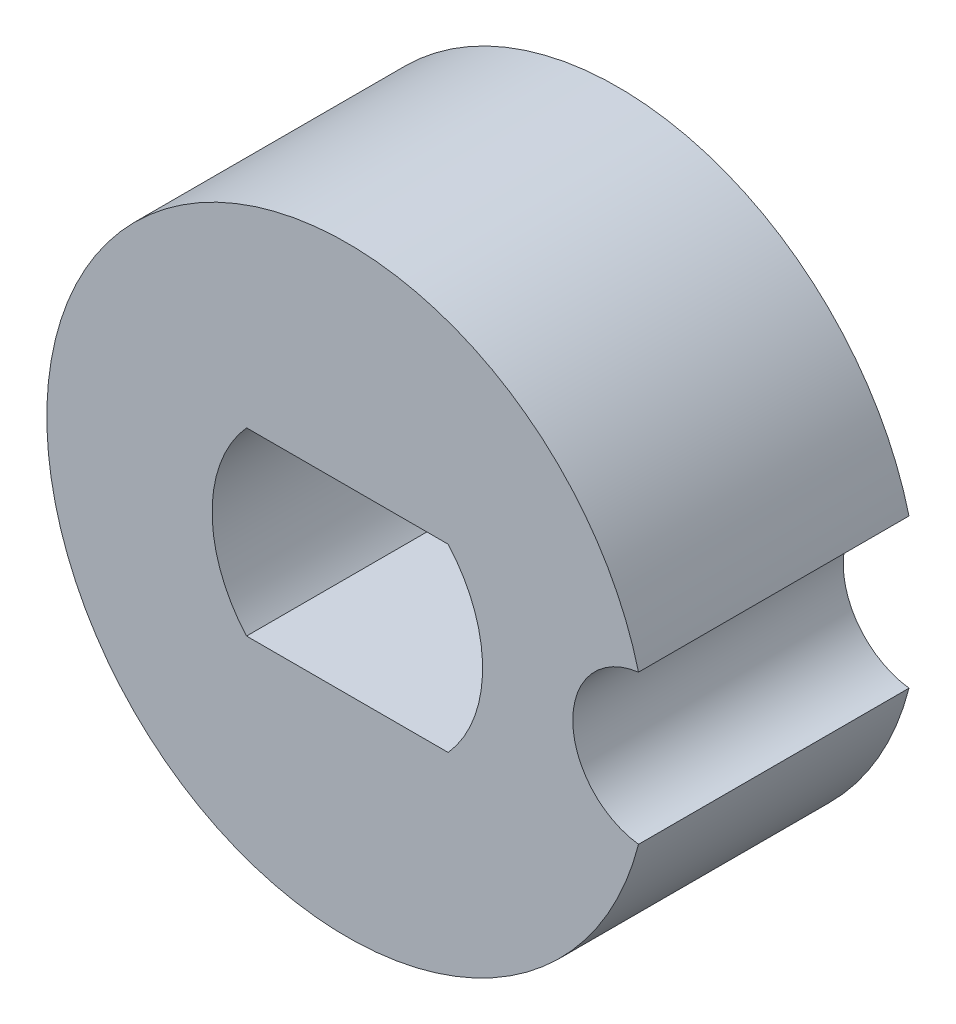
ISO-10303-21;
HEADER;
FILE_DESCRIPTION(('STEP AP214'),'2;1');
FILE_NAME('part.step','',(''),(''),'','','');
FILE_SCHEMA(('AUTOMOTIVE_DESIGN { 1 0 10303 214 1 1 1 1 }'));
ENDSEC;
DATA;
#1=APPLICATION_CONTEXT('core data for automotive mechanical design processes');
#2=APPLICATION_PROTOCOL_DEFINITION('international standard','automotive_design',2000,#1);
#3=PRODUCT_CONTEXT('',#1,'mechanical');
#4=PRODUCT('Part','Part','',(#3));
#5=PRODUCT_RELATED_PRODUCT_CATEGORY('part','',(#4));
#6=PRODUCT_DEFINITION_FORMATION('','',#4);
#7=PRODUCT_DEFINITION_CONTEXT('part definition',#1,'design');
#8=PRODUCT_DEFINITION('design','',#6,#7);
#9=PRODUCT_DEFINITION_SHAPE('','',#8);
#10=(LENGTH_UNIT() NAMED_UNIT(*) SI_UNIT(.MILLI.,.METRE.));
#11=(NAMED_UNIT(*) PLANE_ANGLE_UNIT() SI_UNIT($,.RADIAN.));
#12=(NAMED_UNIT(*) SI_UNIT($,.STERADIAN.) SOLID_ANGLE_UNIT());
#13=UNCERTAINTY_MEASURE_WITH_UNIT(LENGTH_MEASURE(1.E-05),#10,'distance_accuracy_value','');
#14=(GEOMETRIC_REPRESENTATION_CONTEXT(3) GLOBAL_UNCERTAINTY_ASSIGNED_CONTEXT((#13)) GLOBAL_UNIT_ASSIGNED_CONTEXT((#10,
#11,#12)) REPRESENTATION_CONTEXT('',''));
#15=CARTESIAN_POINT('',(0.,0.,0.));
#16=DIRECTION('',(0.,0.,1.));
#17=DIRECTION('',(1.,0.,0.));
#18=AXIS2_PLACEMENT_3D('',#15,#16,#17);
#19=CARTESIAN_POINT('',(5.,0.,9.));
#20=DIRECTION('',(0.,0.,1.));
#21=DIRECTION('',(1.,0.,0.));
#22=AXIS2_PLACEMENT_3D('',#19,#20,#21);
#23=PLANE('',#22);
#24=CARTESIAN_POINT('',(0.,0.,9.));
#25=DIRECTION('',(0.,0.,1.));
#26=DIRECTION('',(1.,0.,0.));
#27=AXIS2_PLACEMENT_3D('',#24,#25,#26);
#28=CIRCLE('',#27,10.);
#29=CARTESIAN_POINT('',(9.6875,2.48039185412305,9.));
#30=VERTEX_POINT('',#29);
#31=CARTESIAN_POINT('',(9.6875,-2.48039185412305,9.));
#32=VERTEX_POINT('',#31);
#33=EDGE_CURVE('E105',#30,#32,#28,.T.);
#34=ORIENTED_EDGE('',*,*,#33,.T.);
#35=CARTESIAN_POINT('',(10.,0.,9.));
#36=DIRECTION('',(0.,0.,1.));
#37=DIRECTION('',(1.,0.,0.));
#38=AXIS2_PLACEMENT_3D('',#35,#36,#37);
#39=CIRCLE('',#38,2.5);
#40=EDGE_CURVE('E108',#30,#32,#39,.T.);
#41=ORIENTED_EDGE('',*,*,#40,.F.);
#42=EDGE_LOOP('',(#34,#41));
#43=FACE_BOUND('',#42,.T.);
#44=DIRECTION('',(-1.,0.,0.));
#45=VECTOR('',#44,1.);
#46=CARTESIAN_POINT('',(3.35410196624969,-3.,9.));
#47=LINE('',#46,#45);
#48=CARTESIAN_POINT('',(3.35410196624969,-3.,9.));
#49=VERTEX_POINT('',#48);
#50=CARTESIAN_POINT('',(-3.35410196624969,-3.,9.));
#51=VERTEX_POINT('',#50);
#52=EDGE_CURVE('E95',#49,#51,#47,.T.);
#53=ORIENTED_EDGE('',*,*,#52,.T.);
#54=CARTESIAN_POINT('',(0.,0.,9.));
#55=DIRECTION('',(0.,0.,1.));
#56=DIRECTION('',(1.,0.,0.));
#57=AXIS2_PLACEMENT_3D('',#54,#55,#56);
#58=CIRCLE('',#57,4.5);
#59=CARTESIAN_POINT('',(-3.35410196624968,3.,9.));
#60=VERTEX_POINT('',#59);
#61=EDGE_CURVE('E68',#60,#51,#58,.T.);
#62=ORIENTED_EDGE('',*,*,#61,.F.);
#63=DIRECTION('',(-1.,0.,0.));
#64=VECTOR('',#63,1.);
#65=CARTESIAN_POINT('',(3.35410196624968,3.,9.));
#66=LINE('',#65,#64);
#67=CARTESIAN_POINT('',(3.35410196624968,3.,9.));
#68=VERTEX_POINT('',#67);
#69=EDGE_CURVE('E90',#68,#60,#66,.T.);
#70=ORIENTED_EDGE('',*,*,#69,.F.);
#71=CARTESIAN_POINT('',(0.,0.,9.));
#72=DIRECTION('',(0.,0.,1.));
#73=DIRECTION('',(1.,0.,0.));
#74=AXIS2_PLACEMENT_3D('',#71,#72,#73);
#75=CIRCLE('',#74,4.5);
#76=EDGE_CURVE('E29',#49,#68,#75,.T.);
#77=ORIENTED_EDGE('',*,*,#76,.F.);
#78=EDGE_LOOP('',(#53,#62,#70,#77));
#79=FACE_BOUND('',#78,.T.);
#80=ADVANCED_FACE('F14',(#43,#79),#23,.T.);
#81=CARTESIAN_POINT('',(5.,0.,0.));
#82=DIRECTION('',(0.,0.,1.));
#83=DIRECTION('',(1.,0.,0.));
#84=AXIS2_PLACEMENT_3D('',#81,#82,#83);
#85=PLANE('',#84);
#86=CARTESIAN_POINT('',(0.,0.,0.));
#87=DIRECTION('',(0.,0.,1.));
#88=DIRECTION('',(1.,0.,0.));
#89=AXIS2_PLACEMENT_3D('',#86,#87,#88);
#90=CIRCLE('',#89,10.);
#91=CARTESIAN_POINT('',(9.6875,2.48039185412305,0.));
#92=VERTEX_POINT('',#91);
#93=CARTESIAN_POINT('',(9.6875,-2.48039185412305,0.));
#94=VERTEX_POINT('',#93);
#95=EDGE_CURVE('E72',#92,#94,#90,.T.);
#96=ORIENTED_EDGE('',*,*,#95,.F.);
#97=CARTESIAN_POINT('',(10.,0.,0.));
#98=DIRECTION('',(0.,0.,1.));
#99=DIRECTION('',(1.,0.,0.));
#100=AXIS2_PLACEMENT_3D('',#97,#98,#99);
#101=CIRCLE('',#100,2.5);
#102=EDGE_CURVE('E102',#92,#94,#101,.T.);
#103=ORIENTED_EDGE('',*,*,#102,.T.);
#104=EDGE_LOOP('',(#96,#103));
#105=FACE_BOUND('',#104,.T.);
#106=CARTESIAN_POINT('',(0.,0.,0.));
#107=DIRECTION('',(0.,0.,1.));
#108=DIRECTION('',(1.,0.,0.));
#109=AXIS2_PLACEMENT_3D('',#106,#107,#108);
#110=CIRCLE('',#109,4.5);
#111=CARTESIAN_POINT('',(-3.35410196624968,3.,0.));
#112=VERTEX_POINT('',#111);
#113=CARTESIAN_POINT('',(-3.35410196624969,-3.,0.));
#114=VERTEX_POINT('',#113);
#115=EDGE_CURVE('E37',#112,#114,#110,.T.);
#116=ORIENTED_EDGE('',*,*,#115,.T.);
#117=DIRECTION('',(-1.,0.,0.));
#118=VECTOR('',#117,1.);
#119=CARTESIAN_POINT('',(3.35410196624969,-3.,0.));
#120=LINE('',#119,#118);
#121=CARTESIAN_POINT('',(3.35410196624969,-3.,0.));
#122=VERTEX_POINT('',#121);
#123=EDGE_CURVE('E76',#122,#114,#120,.T.);
#124=ORIENTED_EDGE('',*,*,#123,.F.);
#125=CARTESIAN_POINT('',(0.,0.,0.));
#126=DIRECTION('',(0.,0.,1.));
#127=DIRECTION('',(1.,0.,0.));
#128=AXIS2_PLACEMENT_3D('',#125,#126,#127);
#129=CIRCLE('',#128,4.5);
#130=CARTESIAN_POINT('',(3.35410196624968,3.,0.));
#131=VERTEX_POINT('',#130);
#132=EDGE_CURVE('E81',#122,#131,#129,.T.);
#133=ORIENTED_EDGE('',*,*,#132,.T.);
#134=DIRECTION('',(-1.,0.,0.));
#135=VECTOR('',#134,1.);
#136=CARTESIAN_POINT('',(3.35410196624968,3.,0.));
#137=LINE('',#136,#135);
#138=EDGE_CURVE('E86',#131,#112,#137,.T.);
#139=ORIENTED_EDGE('',*,*,#138,.T.);
#140=EDGE_LOOP('',(#116,#124,#133,#139));
#141=FACE_BOUND('',#140,.T.);
#142=ADVANCED_FACE('F84',(#105,#141),#85,.F.);
#143=CARTESIAN_POINT('',(0.,0.,9.));
#144=DIRECTION('',(0.,0.,-1.));
#145=DIRECTION('',(-1.,0.,0.));
#146=AXIS2_PLACEMENT_3D('',#143,#144,#145);
#147=CYLINDRICAL_SURFACE('',#146,10.);
#148=DIRECTION('',(0.,0.,-1.));
#149=VECTOR('',#148,1.);
#150=CARTESIAN_POINT('',(9.6875,-2.48039185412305,9.));
#151=LINE('',#150,#149);
#152=EDGE_CURVE('E9',#32,#94,#151,.T.);
#153=ORIENTED_EDGE('',*,*,#152,.F.);
#154=ORIENTED_EDGE('',*,*,#33,.F.);
#155=DIRECTION('',(0.,0.,-1.));
#156=VECTOR('',#155,1.);
#157=CARTESIAN_POINT('',(9.6875,2.48039185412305,9.));
#158=LINE('',#157,#156);
#159=EDGE_CURVE('E22',#30,#92,#158,.T.);
#160=ORIENTED_EDGE('',*,*,#159,.T.);
#161=ORIENTED_EDGE('',*,*,#95,.T.);
#162=EDGE_LOOP('',(#153,#154,#160,#161));
#163=FACE_BOUND('',#162,.T.);
#164=ADVANCED_FACE('F115',(#163),#147,.T.);
#165=CARTESIAN_POINT('',(10.,0.,9.));
#166=DIRECTION('',(0.,0.,-1.));
#167=DIRECTION('',(-1.,0.,0.));
#168=AXIS2_PLACEMENT_3D('',#165,#166,#167);
#169=CYLINDRICAL_SURFACE('',#168,2.5);
#170=ORIENTED_EDGE('',*,*,#40,.T.);
#171=ORIENTED_EDGE('',*,*,#152,.T.);
#172=ORIENTED_EDGE('',*,*,#102,.F.);
#173=ORIENTED_EDGE('',*,*,#159,.F.);
#174=EDGE_LOOP('',(#170,#171,#172,#173));
#175=FACE_BOUND('',#174,.T.);
#176=ADVANCED_FACE('F16',(#175),#169,.F.);
#177=CARTESIAN_POINT('',(0.,0.,9.));
#178=DIRECTION('',(0.,0.,-1.));
#179=DIRECTION('',(-1.,0.,0.));
#180=AXIS2_PLACEMENT_3D('',#177,#178,#179);
#181=CYLINDRICAL_SURFACE('',#180,4.5);
#182=DIRECTION('',(0.,0.,-1.));
#183=VECTOR('',#182,1.);
#184=CARTESIAN_POINT('',(-3.35410196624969,-3.,9.));
#185=LINE('',#184,#183);
#186=EDGE_CURVE('E64',#51,#114,#185,.T.);
#187=ORIENTED_EDGE('',*,*,#186,.T.);
#188=ORIENTED_EDGE('',*,*,#115,.F.);
#189=DIRECTION('',(0.,0.,-1.));
#190=VECTOR('',#189,1.);
#191=CARTESIAN_POINT('',(-3.35410196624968,3.,9.));
#192=LINE('',#191,#190);
#193=EDGE_CURVE('E93',#60,#112,#192,.T.);
#194=ORIENTED_EDGE('',*,*,#193,.F.);
#195=ORIENTED_EDGE('',*,*,#61,.T.);
#196=EDGE_LOOP('',(#187,#188,#194,#195));
#197=FACE_BOUND('',#196,.T.);
#198=ADVANCED_FACE('F66',(#197),#181,.F.);
#199=CARTESIAN_POINT('',(3.35410196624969,-3.,9.));
#200=DIRECTION('',(0.,-1.,0.));
#201=DIRECTION('',(1.,0.,0.));
#202=AXIS2_PLACEMENT_3D('',#199,#200,#201);
#203=PLANE('',#202);
#204=DIRECTION('',(0.,0.,-1.));
#205=VECTOR('',#204,1.);
#206=CARTESIAN_POINT('',(3.35410196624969,-3.,9.));
#207=LINE('',#206,#205);
#208=EDGE_CURVE('E73',#49,#122,#207,.T.);
#209=ORIENTED_EDGE('',*,*,#208,.T.);
#210=ORIENTED_EDGE('',*,*,#123,.T.);
#211=ORIENTED_EDGE('',*,*,#186,.F.);
#212=ORIENTED_EDGE('',*,*,#52,.F.);
#213=EDGE_LOOP('',(#209,#210,#211,#212));
#214=FACE_BOUND('',#213,.T.);
#215=ADVANCED_FACE('F77',(#214),#203,.F.);
#216=CARTESIAN_POINT('',(0.,0.,9.));
#217=DIRECTION('',(0.,0.,-1.));
#218=DIRECTION('',(-1.,0.,0.));
#219=AXIS2_PLACEMENT_3D('',#216,#217,#218);
#220=CYLINDRICAL_SURFACE('',#219,4.5);
#221=DIRECTION('',(0.,0.,-1.));
#222=VECTOR('',#221,1.);
#223=CARTESIAN_POINT('',(3.35410196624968,3.,9.));
#224=LINE('',#223,#222);
#225=EDGE_CURVE('E99',#68,#131,#224,.T.);
#226=ORIENTED_EDGE('',*,*,#225,.T.);
#227=ORIENTED_EDGE('',*,*,#132,.F.);
#228=ORIENTED_EDGE('',*,*,#208,.F.);
#229=ORIENTED_EDGE('',*,*,#76,.T.);
#230=EDGE_LOOP('',(#226,#227,#228,#229));
#231=FACE_BOUND('',#230,.T.);
#232=ADVANCED_FACE('F127',(#231),#220,.F.);
#233=CARTESIAN_POINT('',(3.35410196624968,3.,9.));
#234=DIRECTION('',(0.,-1.,0.));
#235=DIRECTION('',(1.,0.,0.));
#236=AXIS2_PLACEMENT_3D('',#233,#234,#235);
#237=PLANE('',#236);
#238=ORIENTED_EDGE('',*,*,#69,.T.);
#239=ORIENTED_EDGE('',*,*,#193,.T.);
#240=ORIENTED_EDGE('',*,*,#138,.F.);
#241=ORIENTED_EDGE('',*,*,#225,.F.);
#242=EDGE_LOOP('',(#238,#239,#240,#241));
#243=FACE_BOUND('',#242,.T.);
#244=ADVANCED_FACE('F126',(#243),#237,.T.);
#245=CLOSED_SHELL('',(#80,#142,#164,#176,#198,#215,#232,#244));
#246=MANIFOLD_SOLID_BREP('B1',#245);
#247=ADVANCED_BREP_SHAPE_REPRESENTATION('',(#18,#246),#14);
#248=SHAPE_DEFINITION_REPRESENTATION(#9,#247);
ENDSEC;
END-ISO-10303-21;
